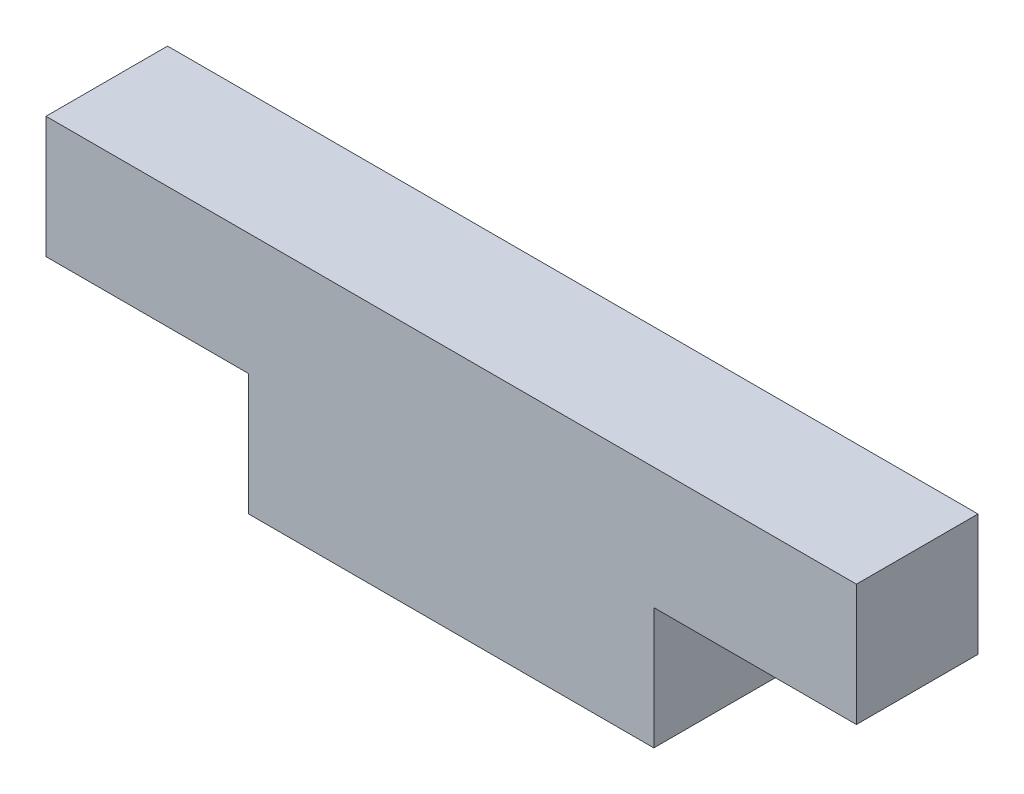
from build123d import *

# Parameters (mm, degrees)
BOSS_EXTRU_1_DEPTH = 3


with BuildPart() as part:
    # Esquisse1 → Boss.-Extru.1 (new body)
    with BuildSketch(Plane.XY):
        Polygon((0, 0), (0, 6), (-10, 6), (-10, 3), (-5, 3), (-5, 0), align=None)
    boss_extru_1 = extrude(amount=BOSS_EXTRU_1_DEPTH)

    # Sym_trie1: Boss.-Extru.1 across plane
    add(boss_extru_1.mirror(Plane(origin=(0, 0, 3), x_dir=(0, 0, 1), z_dir=(-1, 0, 0))))


solid = part.part
